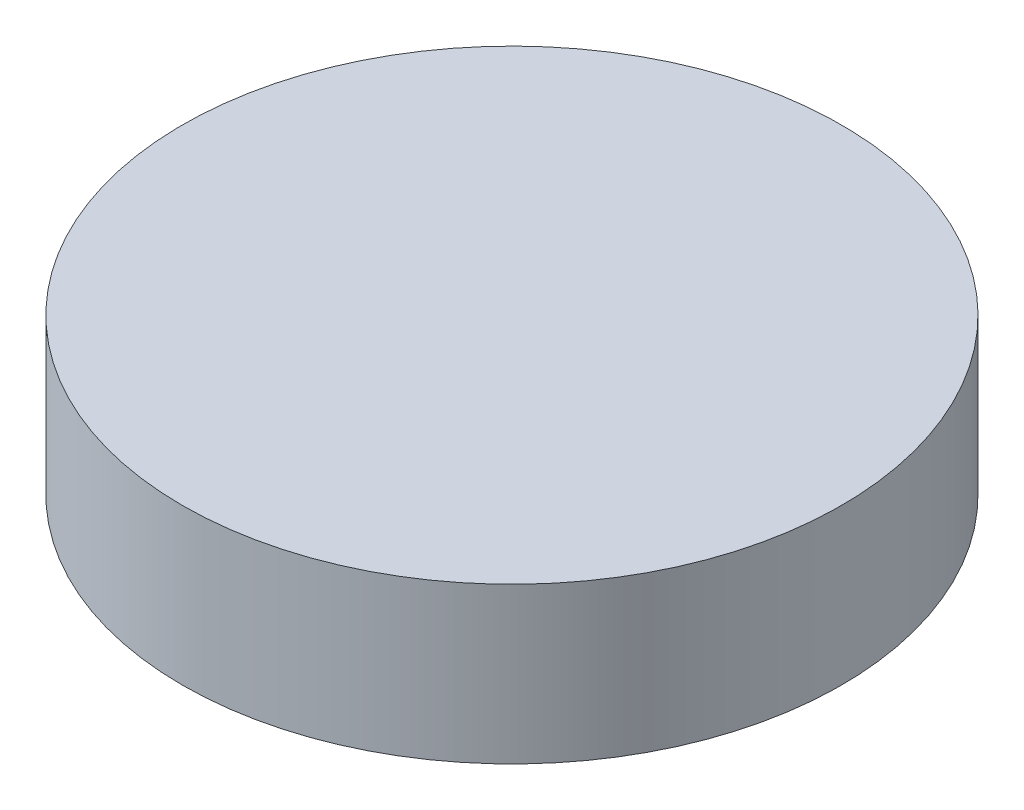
ISO-10303-21;
HEADER;
FILE_DESCRIPTION(('STEP AP214'),'2;1');
FILE_NAME('part.step','',(''),(''),'','','');
FILE_SCHEMA(('AUTOMOTIVE_DESIGN { 1 0 10303 214 1 1 1 1 }'));
ENDSEC;
DATA;
#1=APPLICATION_CONTEXT('core data for automotive mechanical design processes');
#2=APPLICATION_PROTOCOL_DEFINITION('international standard','automotive_design',2000,#1);
#3=PRODUCT_CONTEXT('',#1,'mechanical');
#4=PRODUCT('Part','Part','',(#3));
#5=PRODUCT_RELATED_PRODUCT_CATEGORY('part','',(#4));
#6=PRODUCT_DEFINITION_FORMATION('','',#4);
#7=PRODUCT_DEFINITION_CONTEXT('part definition',#1,'design');
#8=PRODUCT_DEFINITION('design','',#6,#7);
#9=PRODUCT_DEFINITION_SHAPE('','',#8);
#10=(LENGTH_UNIT() NAMED_UNIT(*) SI_UNIT(.MILLI.,.METRE.));
#11=(NAMED_UNIT(*) PLANE_ANGLE_UNIT() SI_UNIT($,.RADIAN.));
#12=(NAMED_UNIT(*) SI_UNIT($,.STERADIAN.) SOLID_ANGLE_UNIT());
#13=UNCERTAINTY_MEASURE_WITH_UNIT(LENGTH_MEASURE(1.E-05),#10,'distance_accuracy_value','');
#14=(GEOMETRIC_REPRESENTATION_CONTEXT(3) GLOBAL_UNCERTAINTY_ASSIGNED_CONTEXT((#13)) GLOBAL_UNIT_ASSIGNED_CONTEXT((#10,
#11,#12)) REPRESENTATION_CONTEXT('',''));
#15=CARTESIAN_POINT('',(0.,0.,0.));
#16=DIRECTION('',(0.,0.,1.));
#17=DIRECTION('',(1.,0.,0.));
#18=AXIS2_PLACEMENT_3D('',#15,#16,#17);
#19=CARTESIAN_POINT('',(0.,21.25,0.));
#20=DIRECTION('',(0.,-1.,0.));
#21=DIRECTION('',(0.,0.,-1.));
#22=AXIS2_PLACEMENT_3D('',#19,#20,#21);
#23=CYLINDRICAL_SURFACE('',#22,45.);
#24=CARTESIAN_POINT('',(0.,21.25,0.));
#25=DIRECTION('',(0.,1.,0.));
#26=DIRECTION('',(0.,0.,1.));
#27=AXIS2_PLACEMENT_3D('',#24,#25,#26);
#28=CIRCLE('',#27,45.);
#29=CARTESIAN_POINT('',(0.,21.25,45.));
#30=VERTEX_POINT('',#29);
#31=EDGE_CURVE('E10',#30,#30,#28,.T.);
#32=ORIENTED_EDGE('',*,*,#31,.F.);
#33=EDGE_LOOP('',(#32));
#34=FACE_BOUND('',#33,.T.);
#35=CARTESIAN_POINT('',(0.,0.,0.));
#36=DIRECTION('',(0.,1.,0.));
#37=DIRECTION('',(0.,0.,1.));
#38=AXIS2_PLACEMENT_3D('',#35,#36,#37);
#39=CIRCLE('',#38,45.);
#40=CARTESIAN_POINT('',(0.,0.,45.));
#41=VERTEX_POINT('',#40);
#42=EDGE_CURVE('E49',#41,#41,#39,.T.);
#43=ORIENTED_EDGE('',*,*,#42,.T.);
#44=EDGE_LOOP('',(#43));
#45=FACE_BOUND('',#44,.T.);
#46=ADVANCED_FACE('F46',(#34,#45),#23,.T.);
#47=CARTESIAN_POINT('',(0.,21.25,0.));
#48=DIRECTION('',(0.,1.,0.));
#49=DIRECTION('',(0.,0.,1.));
#50=AXIS2_PLACEMENT_3D('',#47,#48,#49);
#51=PLANE('',#50);
#52=ORIENTED_EDGE('',*,*,#31,.T.);
#53=EDGE_LOOP('',(#52));
#54=FACE_BOUND('',#53,.T.);
#55=ADVANCED_FACE('F75',(#54),#51,.T.);
#56=CARTESIAN_POINT('',(0.,0.,0.));
#57=DIRECTION('',(0.,1.,0.));
#58=DIRECTION('',(0.,0.,1.));
#59=AXIS2_PLACEMENT_3D('',#56,#57,#58);
#60=PLANE('',#59);
#61=CARTESIAN_POINT('',(0.,0.,0.));
#62=DIRECTION('',(0.,-1.,0.));
#63=DIRECTION('',(0.,0.,-1.));
#64=AXIS2_PLACEMENT_3D('',#61,#62,#63);
#65=CIRCLE('',#64,10.);
#66=CARTESIAN_POINT('',(0.,0.,-10.));
#67=VERTEX_POINT('',#66);
#68=EDGE_CURVE('E58',#67,#67,#65,.T.);
#69=ORIENTED_EDGE('',*,*,#68,.F.);
#70=EDGE_LOOP('',(#69));
#71=FACE_BOUND('',#70,.T.);
#72=ORIENTED_EDGE('',*,*,#42,.F.);
#73=EDGE_LOOP('',(#72));
#74=FACE_BOUND('',#73,.T.);
#75=ADVANCED_FACE('F69',(#71,#74),#60,.F.);
#76=CARTESIAN_POINT('',(0.,20.,0.));
#77=DIRECTION('',(0.,-1.,0.));
#78=DIRECTION('',(0.,0.,-1.));
#79=AXIS2_PLACEMENT_3D('',#76,#77,#78);
#80=CYLINDRICAL_SURFACE('',#79,10.);
#81=CARTESIAN_POINT('',(0.,20.,0.));
#82=DIRECTION('',(0.,-1.,0.));
#83=DIRECTION('',(0.,0.,-1.));
#84=AXIS2_PLACEMENT_3D('',#81,#82,#83);
#85=CIRCLE('',#84,10.);
#86=CARTESIAN_POINT('',(0.,20.,-10.));
#87=VERTEX_POINT('',#86);
#88=EDGE_CURVE('E56',#87,#87,#85,.T.);
#89=ORIENTED_EDGE('',*,*,#88,.F.);
#90=EDGE_LOOP('',(#89));
#91=FACE_BOUND('',#90,.T.);
#92=ORIENTED_EDGE('',*,*,#68,.T.);
#93=EDGE_LOOP('',(#92));
#94=FACE_BOUND('',#93,.T.);
#95=ADVANCED_FACE('F66',(#91,#94),#80,.F.);
#96=CARTESIAN_POINT('',(0.,20.,0.));
#97=DIRECTION('',(0.,-1.,0.));
#98=DIRECTION('',(0.,0.,-1.));
#99=AXIS2_PLACEMENT_3D('',#96,#97,#98);
#100=PLANE('',#99);
#101=ORIENTED_EDGE('',*,*,#88,.T.);
#102=EDGE_LOOP('',(#101));
#103=FACE_BOUND('',#102,.T.);
#104=ADVANCED_FACE('F64',(#103),#100,.T.);
#105=CLOSED_SHELL('',(#46,#55,#75,#95,#104));
#106=MANIFOLD_SOLID_BREP('B2',#105);
#107=ADVANCED_BREP_SHAPE_REPRESENTATION('',(#18,#106),#14);
#108=SHAPE_DEFINITION_REPRESENTATION(#9,#107);
ENDSEC;
END-ISO-10303-21;
